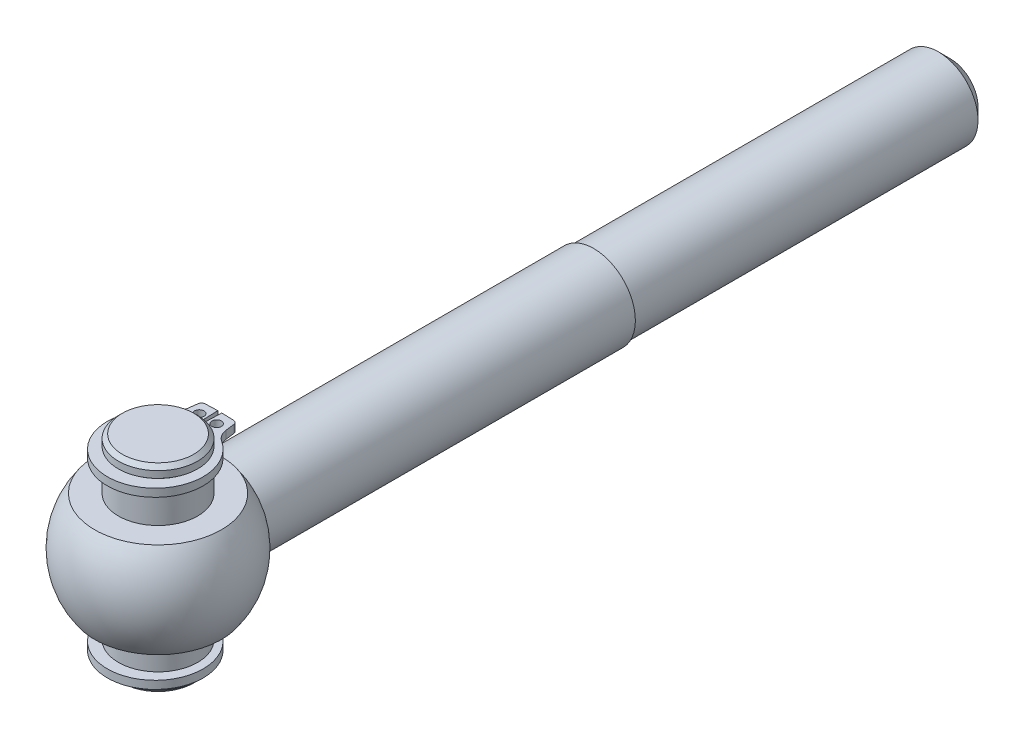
ISO-10303-21;
HEADER;
FILE_DESCRIPTION(('STEP AP214'),'2;1');
FILE_NAME('part.step','',(''),(''),'','','');
FILE_SCHEMA(('AUTOMOTIVE_DESIGN { 1 0 10303 214 1 1 1 1 }'));
ENDSEC;
DATA;
#1=APPLICATION_CONTEXT('core data for automotive mechanical design processes');
#2=APPLICATION_PROTOCOL_DEFINITION('international standard','automotive_design',2000,#1);
#3=PRODUCT_CONTEXT('',#1,'mechanical');
#4=PRODUCT('Part','Part','',(#3));
#5=PRODUCT_RELATED_PRODUCT_CATEGORY('part','',(#4));
#6=PRODUCT_DEFINITION_FORMATION('','',#4);
#7=PRODUCT_DEFINITION_CONTEXT('part definition',#1,'design');
#8=PRODUCT_DEFINITION('design','',#6,#7);
#9=PRODUCT_DEFINITION_SHAPE('','',#8);
#10=(LENGTH_UNIT() NAMED_UNIT(*) SI_UNIT(.MILLI.,.METRE.));
#11=(NAMED_UNIT(*) PLANE_ANGLE_UNIT() SI_UNIT($,.RADIAN.));
#12=(NAMED_UNIT(*) SI_UNIT($,.STERADIAN.) SOLID_ANGLE_UNIT());
#13=UNCERTAINTY_MEASURE_WITH_UNIT(LENGTH_MEASURE(1.E-05),#10,'distance_accuracy_value','');
#14=(GEOMETRIC_REPRESENTATION_CONTEXT(3) GLOBAL_UNCERTAINTY_ASSIGNED_CONTEXT((#13)) GLOBAL_UNIT_ASSIGNED_CONTEXT((#10,
#11,#12)) REPRESENTATION_CONTEXT('',''));
#15=CARTESIAN_POINT('',(0.,0.,0.));
#16=DIRECTION('',(0.,0.,1.));
#17=DIRECTION('',(1.,0.,0.));
#18=AXIS2_PLACEMENT_3D('',#15,#16,#17);
#19=CARTESIAN_POINT('',(0.,-11.0000000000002,100.));
#20=DIRECTION('',(0.,1.,0.));
#21=DIRECTION('',(-1.,0.,0.));
#22=AXIS2_PLACEMENT_3D('',#19,#20,#21);
#23=PLANE('',#22);
#24=CARTESIAN_POINT('',(1.09999999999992,-11.0000000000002,93.6952398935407));
#25=DIRECTION('',(0.,1.,0.));
#26=DIRECTION('',(-1.,0.,0.));
#27=AXIS2_PLACEMENT_3D('',#24,#25,#26);
#28=CIRCLE('',#27,0.6);
#29=CARTESIAN_POINT('',(0.499999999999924,-11.0000000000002,93.6952398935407));
#30=VERTEX_POINT('',#29);
#31=EDGE_CURVE('E953',#30,#30,#28,.T.);
#32=ORIENTED_EDGE('',*,*,#31,.T.);
#33=EDGE_LOOP('',(#32));
#34=FACE_BOUND('',#33,.T.);
#35=CARTESIAN_POINT('',(-1.10000000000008,-11.0000000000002,93.6952398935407));
#36=DIRECTION('',(0.,1.,0.));
#37=DIRECTION('',(-1.,0.,0.));
#38=AXIS2_PLACEMENT_3D('',#35,#36,#37);
#39=CIRCLE('',#38,0.6);
#40=CARTESIAN_POINT('',(-1.70000000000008,-11.0000000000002,93.6952398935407));
#41=VERTEX_POINT('',#40);
#42=EDGE_CURVE('E952',#41,#41,#39,.T.);
#43=ORIENTED_EDGE('',*,*,#42,.T.);
#44=EDGE_LOOP('',(#43));
#45=FACE_BOUND('',#44,.T.);
#46=CARTESIAN_POINT('',(0.,-11.0000000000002,100.));
#47=DIRECTION('',(0.,-1.,0.));
#48=DIRECTION('',(-1.,0.,0.));
#49=AXIS2_PLACEMENT_3D('',#46,#47,#48);
#50=CIRCLE('',#49,4.8);
#51=CARTESIAN_POINT('',(0.153846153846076,-11.0000000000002,95.2024661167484));
#52=VERTEX_POINT('',#51);
#53=CARTESIAN_POINT('',(-0.153846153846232,-11.0000000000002,95.2024661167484));
#54=VERTEX_POINT('',#53);
#55=EDGE_CURVE('E205',#52,#54,#50,.T.);
#56=ORIENTED_EDGE('',*,*,#55,.F.);
#57=DIRECTION('',(-0.0320512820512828,0.,0.999486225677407));
#58=VECTOR('',#57,1.);
#59=CARTESIAN_POINT('',(0.153846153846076,-11.0000000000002,95.2024661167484));
#60=LINE('',#59,#58);
#61=CARTESIAN_POINT('',(0.249999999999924,-11.0000000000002,92.2040074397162));
#62=VERTEX_POINT('',#61);
#63=EDGE_CURVE('E207',#62,#52,#60,.T.);
#64=ORIENTED_EDGE('',*,*,#63,.F.);
#65=DIRECTION('',(-0.999486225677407,0.,-0.0320512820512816));
#66=VECTOR('',#65,1.);
#67=CARTESIAN_POINT('',(0.249999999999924,-11.0000000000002,92.2040074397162));
#68=LINE('',#67,#66);
#69=CARTESIAN_POINT('',(1.77924534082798,-11.0000000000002,92.2530469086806));
#70=VERTEX_POINT('',#69);
#71=EDGE_CURVE('E218',#70,#62,#68,.T.);
#72=ORIENTED_EDGE('',*,*,#71,.F.);
#73=CARTESIAN_POINT('',(1.76321969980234,-11.0000000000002,92.7527900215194));
#74=DIRECTION('',(0.,1.,0.));
#75=DIRECTION('',(-1.,0.,0.));
#76=AXIS2_PLACEMENT_3D('',#73,#74,#75);
#77=CIRCLE('',#76,0.5);
#78=CARTESIAN_POINT('',(2.25894213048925,-11.0000000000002,92.6875269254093));
#79=VERTEX_POINT('',#78);
#80=EDGE_CURVE('E222',#79,#70,#77,.T.);
#81=ORIENTED_EDGE('',*,*,#80,.F.);
#82=DIRECTION('',(-0.130526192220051,0.,-0.99144486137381));
#83=VECTOR('',#82,1.);
#84=CARTESIAN_POINT('',(2.41181577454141,-11.0000000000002,93.8487175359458));
#85=LINE('',#84,#83);
#86=CARTESIAN_POINT('',(2.41181577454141,-11.0000000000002,93.8487175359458));
#87=VERTEX_POINT('',#86);
#88=EDGE_CURVE('E927',#87,#79,#85,.T.);
#89=ORIENTED_EDGE('',*,*,#88,.F.);
#90=CARTESIAN_POINT('',(4.43354857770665,-11.0000000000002,93.5825513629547));
#91=DIRECTION('',(0.,-1.,0.));
#92=DIRECTION('',(-1.,0.,0.));
#93=AXIS2_PLACEMENT_3D('',#90,#91,#92);
#94=CIRCLE('',#93,2.03917825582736);
#95=CARTESIAN_POINT('',(3.31600032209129,-11.0000000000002,95.2882283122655));
#96=VERTEX_POINT('',#95);
#97=EDGE_CURVE('E928',#96,#87,#94,.T.);
#98=ORIENTED_EDGE('',*,*,#97,.F.);
#99=CARTESIAN_POINT('',(0.,-11.0000000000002,100.349329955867));
#100=DIRECTION('',(0.,1.,0.));
#101=DIRECTION('',(-1.,0.,0.));
#102=AXIS2_PLACEMENT_3D('',#99,#100,#101);
#103=CIRCLE('',#102,6.05067004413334);
#104=CARTESIAN_POINT('',(-3.31600032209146,-11.0000000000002,95.2882283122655));
#105=VERTEX_POINT('',#104);
#106=EDGE_CURVE('E933',#105,#96,#103,.T.);
#107=ORIENTED_EDGE('',*,*,#106,.F.);
#108=CARTESIAN_POINT('',(-4.43354857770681,-11.0000000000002,93.5825513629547));
#109=DIRECTION('',(0.,-1.,0.));
#110=DIRECTION('',(-1.,0.,0.));
#111=AXIS2_PLACEMENT_3D('',#108,#109,#110);
#112=CIRCLE('',#111,2.03917825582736);
#113=CARTESIAN_POINT('',(-2.41181577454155,-11.0000000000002,93.8487175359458));
#114=VERTEX_POINT('',#113);
#115=EDGE_CURVE('E936',#114,#105,#112,.T.);
#116=ORIENTED_EDGE('',*,*,#115,.F.);
#117=DIRECTION('',(-0.130526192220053,0.,0.99144486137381));
#118=VECTOR('',#117,1.);
#119=CARTESIAN_POINT('',(-2.41181577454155,-11.0000000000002,93.8487175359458));
#120=LINE('',#119,#118);
#121=CARTESIAN_POINT('',(-2.2589421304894,-11.0000000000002,92.6875269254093));
#122=VERTEX_POINT('',#121);
#123=EDGE_CURVE('E939',#122,#114,#120,.T.);
#124=ORIENTED_EDGE('',*,*,#123,.F.);
#125=CARTESIAN_POINT('',(-1.76321969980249,-11.0000000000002,92.7527900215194));
#126=DIRECTION('',(0.,1.,0.));
#127=DIRECTION('',(1.,0.,0.));
#128=AXIS2_PLACEMENT_3D('',#125,#126,#127);
#129=CIRCLE('',#128,0.5);
#130=CARTESIAN_POINT('',(-1.77924534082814,-11.0000000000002,92.2530469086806));
#131=VERTEX_POINT('',#130);
#132=EDGE_CURVE('E942',#131,#122,#129,.T.);
#133=ORIENTED_EDGE('',*,*,#132,.F.);
#134=DIRECTION('',(-0.999486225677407,0.,0.0320512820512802));
#135=VECTOR('',#134,1.);
#136=CARTESIAN_POINT('',(-0.250000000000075,-11.0000000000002,92.2040074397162));
#137=LINE('',#136,#135);
#138=CARTESIAN_POINT('',(-0.250000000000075,-11.0000000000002,92.2040074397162));
#139=VERTEX_POINT('',#138);
#140=EDGE_CURVE('E945',#139,#131,#137,.T.);
#141=ORIENTED_EDGE('',*,*,#140,.F.);
#142=DIRECTION('',(-0.0320512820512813,0.,-0.999486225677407));
#143=VECTOR('',#142,1.);
#144=CARTESIAN_POINT('',(-0.153846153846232,-11.0000000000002,95.2024661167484));
#145=LINE('',#144,#143);
#146=EDGE_CURVE('E209',#54,#139,#145,.T.);
#147=ORIENTED_EDGE('',*,*,#146,.F.);
#148=EDGE_LOOP('',(#56,#64,#72,#81,#89,#98,#107,#116,#124,#133,#141,#147));
#149=FACE_BOUND('',#148,.T.);
#150=ADVANCED_FACE('F14',(#34,#45,#149),#23,.F.);
#151=CARTESIAN_POINT('',(-1.10000000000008,-11.0000000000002,93.6952398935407));
#152=DIRECTION('',(0.,1.,0.));
#153=DIRECTION('',(-1.,0.,0.));
#154=AXIS2_PLACEMENT_3D('',#151,#152,#153);
#155=CYLINDRICAL_SURFACE('',#154,0.6);
#156=ORIENTED_EDGE('',*,*,#42,.F.);
#157=EDGE_LOOP('',(#156));
#158=FACE_BOUND('',#157,.T.);
#159=CARTESIAN_POINT('',(-1.10000000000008,-10.0000000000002,93.6952398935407));
#160=DIRECTION('',(0.,1.,0.));
#161=DIRECTION('',(-1.,0.,0.));
#162=AXIS2_PLACEMENT_3D('',#159,#160,#161);
#163=CIRCLE('',#162,0.6);
#164=CARTESIAN_POINT('',(-1.70000000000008,-10.0000000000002,93.6952398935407));
#165=VERTEX_POINT('',#164);
#166=EDGE_CURVE('E949',#165,#165,#163,.T.);
#167=ORIENTED_EDGE('',*,*,#166,.T.);
#168=EDGE_LOOP('',(#167));
#169=FACE_BOUND('',#168,.T.);
#170=ADVANCED_FACE('F773',(#158,#169),#155,.F.);
#171=CARTESIAN_POINT('',(1.09999999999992,-11.0000000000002,93.6952398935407));
#172=DIRECTION('',(0.,1.,0.));
#173=DIRECTION('',(-1.,0.,0.));
#174=AXIS2_PLACEMENT_3D('',#171,#172,#173);
#175=CYLINDRICAL_SURFACE('',#174,0.6);
#176=ORIENTED_EDGE('',*,*,#31,.F.);
#177=EDGE_LOOP('',(#176));
#178=FACE_BOUND('',#177,.T.);
#179=CARTESIAN_POINT('',(1.09999999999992,-10.0000000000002,93.6952398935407));
#180=DIRECTION('',(0.,1.,0.));
#181=DIRECTION('',(-1.,0.,0.));
#182=AXIS2_PLACEMENT_3D('',#179,#180,#181);
#183=CIRCLE('',#182,0.6);
#184=CARTESIAN_POINT('',(0.499999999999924,-10.0000000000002,93.6952398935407));
#185=VERTEX_POINT('',#184);
#186=EDGE_CURVE('E385',#185,#185,#183,.T.);
#187=ORIENTED_EDGE('',*,*,#186,.T.);
#188=EDGE_LOOP('',(#187));
#189=FACE_BOUND('',#188,.T.);
#190=ADVANCED_FACE('F766',(#178,#189),#175,.F.);
#191=CARTESIAN_POINT('',(0.153846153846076,-11.0000000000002,95.2024661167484));
#192=DIRECTION('',(-0.999486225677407,0.,-0.0320512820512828));
#193=DIRECTION('',(-0.0320512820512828,0.,0.999486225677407));
#194=AXIS2_PLACEMENT_3D('',#191,#192,#193);
#195=PLANE('',#194);
#196=DIRECTION('',(-0.0320512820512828,0.,0.999486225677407));
#197=VECTOR('',#196,1.);
#198=CARTESIAN_POINT('',(0.153846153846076,-10.0000000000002,95.2024661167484));
#199=LINE('',#198,#197);
#200=CARTESIAN_POINT('',(0.249999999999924,-10.0000000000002,92.2040074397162));
#201=VERTEX_POINT('',#200);
#202=CARTESIAN_POINT('',(0.160256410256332,-10.0000000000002,95.002568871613));
#203=VERTEX_POINT('',#202);
#204=EDGE_CURVE('E210',#201,#203,#199,.T.);
#205=ORIENTED_EDGE('',*,*,#204,.F.);
#206=DIRECTION('',(0.,1.,0.));
#207=VECTOR('',#206,1.);
#208=CARTESIAN_POINT('',(0.249999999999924,-11.0000000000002,92.2040074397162));
#209=LINE('',#208,#207);
#210=EDGE_CURVE('E199',#62,#201,#209,.T.);
#211=ORIENTED_EDGE('',*,*,#210,.F.);
#212=ORIENTED_EDGE('',*,*,#63,.T.);
#213=DIRECTION('',(0.,1.,0.));
#214=VECTOR('',#213,1.);
#215=CARTESIAN_POINT('',(0.153846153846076,-11.0000000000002,95.2024661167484));
#216=LINE('',#215,#214);
#217=CARTESIAN_POINT('',(0.153846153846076,-10.0000000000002,95.2024661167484));
#218=VERTEX_POINT('',#217);
#219=EDGE_CURVE('E24',#52,#218,#216,.T.);
#220=ORIENTED_EDGE('',*,*,#219,.T.);
#221=EDGE_CURVE('E33',#203,#218,#199,.T.);
#222=ORIENTED_EDGE('',*,*,#221,.F.);
#223=EDGE_LOOP('',(#205,#211,#212,#220,#222));
#224=FACE_BOUND('',#223,.T.);
#225=ADVANCED_FACE('F217',(#224),#195,.T.);
#226=CARTESIAN_POINT('',(0.249999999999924,-11.0000000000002,92.2040074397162));
#227=DIRECTION('',(0.0320512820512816,0.,-0.999486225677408));
#228=DIRECTION('',(-0.999486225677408,0.,-0.0320512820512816));
#229=AXIS2_PLACEMENT_3D('',#226,#227,#228);
#230=PLANE('',#229);
#231=DIRECTION('',(-0.999486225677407,0.,-0.0320512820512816));
#232=VECTOR('',#231,1.);
#233=CARTESIAN_POINT('',(0.249999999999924,-10.0000000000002,92.2040074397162));
#234=LINE('',#233,#232);
#235=CARTESIAN_POINT('',(1.77924534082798,-10.0000000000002,92.2530469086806));
#236=VERTEX_POINT('',#235);
#237=EDGE_CURVE('E254',#236,#201,#234,.T.);
#238=ORIENTED_EDGE('',*,*,#237,.F.);
#239=DIRECTION('',(0.,1.,0.));
#240=VECTOR('',#239,1.);
#241=CARTESIAN_POINT('',(1.77924534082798,-11.0000000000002,92.2530469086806));
#242=LINE('',#241,#240);
#243=EDGE_CURVE('E260',#70,#236,#242,.T.);
#244=ORIENTED_EDGE('',*,*,#243,.F.);
#245=ORIENTED_EDGE('',*,*,#71,.T.);
#246=ORIENTED_EDGE('',*,*,#210,.T.);
#247=EDGE_LOOP('',(#238,#244,#245,#246));
#248=FACE_BOUND('',#247,.T.);
#249=ADVANCED_FACE('F751',(#248),#230,.T.);
#250=CARTESIAN_POINT('',(1.76321969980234,-11.0000000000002,92.7527900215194));
#251=DIRECTION('',(0.,1.,0.));
#252=DIRECTION('',(-1.,0.,0.));
#253=AXIS2_PLACEMENT_3D('',#250,#251,#252);
#254=CYLINDRICAL_SURFACE('',#253,0.5);
#255=CARTESIAN_POINT('',(1.76321969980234,-10.0000000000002,92.7527900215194));
#256=DIRECTION('',(0.,1.,0.));
#257=DIRECTION('',(-1.,0.,0.));
#258=AXIS2_PLACEMENT_3D('',#255,#256,#257);
#259=CIRCLE('',#258,0.5);
#260=CARTESIAN_POINT('',(2.25894213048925,-10.0000000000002,92.6875269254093));
#261=VERTEX_POINT('',#260);
#262=EDGE_CURVE('E251',#261,#236,#259,.T.);
#263=ORIENTED_EDGE('',*,*,#262,.F.);
#264=DIRECTION('',(0.,1.,0.));
#265=VECTOR('',#264,1.);
#266=CARTESIAN_POINT('',(2.25894213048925,-11.0000000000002,92.6875269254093));
#267=LINE('',#266,#265);
#268=EDGE_CURVE('E262',#79,#261,#267,.T.);
#269=ORIENTED_EDGE('',*,*,#268,.F.);
#270=ORIENTED_EDGE('',*,*,#80,.T.);
#271=ORIENTED_EDGE('',*,*,#243,.T.);
#272=EDGE_LOOP('',(#263,#269,#270,#271));
#273=FACE_BOUND('',#272,.T.);
#274=ADVANCED_FACE('F743',(#273),#254,.T.);
#275=CARTESIAN_POINT('',(2.41181577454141,-11.0000000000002,93.8487175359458));
#276=DIRECTION('',(0.99144486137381,0.,-0.130526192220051));
#277=DIRECTION('',(-0.130526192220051,0.,-0.99144486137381));
#278=AXIS2_PLACEMENT_3D('',#275,#276,#277);
#279=PLANE('',#278);
#280=DIRECTION('',(-0.130526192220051,0.,-0.99144486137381));
#281=VECTOR('',#280,1.);
#282=CARTESIAN_POINT('',(2.41181577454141,-10.0000000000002,93.8487175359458));
#283=LINE('',#282,#281);
#284=CARTESIAN_POINT('',(2.41181577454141,-10.0000000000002,93.8487175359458));
#285=VERTEX_POINT('',#284);
#286=EDGE_CURVE('E248',#285,#261,#283,.T.);
#287=ORIENTED_EDGE('',*,*,#286,.F.);
#288=DIRECTION('',(0.,1.,0.));
#289=VECTOR('',#288,1.);
#290=CARTESIAN_POINT('',(2.41181577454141,-11.0000000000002,93.8487175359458));
#291=LINE('',#290,#289);
#292=EDGE_CURVE('E264',#87,#285,#291,.T.);
#293=ORIENTED_EDGE('',*,*,#292,.F.);
#294=ORIENTED_EDGE('',*,*,#88,.T.);
#295=ORIENTED_EDGE('',*,*,#268,.T.);
#296=EDGE_LOOP('',(#287,#293,#294,#295));
#297=FACE_BOUND('',#296,.T.);
#298=ADVANCED_FACE('F735',(#297),#279,.T.);
#299=CARTESIAN_POINT('',(4.43354857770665,-11.0000000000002,93.5825513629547));
#300=DIRECTION('',(0.,1.,0.));
#301=DIRECTION('',(-1.,0.,0.));
#302=AXIS2_PLACEMENT_3D('',#299,#300,#301);
#303=CYLINDRICAL_SURFACE('',#302,2.03917825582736);
#304=CARTESIAN_POINT('',(4.43354857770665,-10.0000000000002,93.5825513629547));
#305=DIRECTION('',(0.,-1.,0.));
#306=DIRECTION('',(-1.,0.,0.));
#307=AXIS2_PLACEMENT_3D('',#304,#305,#306);
#308=CIRCLE('',#307,2.03917825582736);
#309=CARTESIAN_POINT('',(3.31600032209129,-10.0000000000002,95.2882283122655));
#310=VERTEX_POINT('',#309);
#311=EDGE_CURVE('E245',#310,#285,#308,.T.);
#312=ORIENTED_EDGE('',*,*,#311,.F.);
#313=DIRECTION('',(0.,1.,0.));
#314=VECTOR('',#313,1.);
#315=CARTESIAN_POINT('',(3.31600032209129,-11.0000000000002,95.2882283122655));
#316=LINE('',#315,#314);
#317=EDGE_CURVE('E266',#96,#310,#316,.T.);
#318=ORIENTED_EDGE('',*,*,#317,.F.);
#319=ORIENTED_EDGE('',*,*,#97,.T.);
#320=ORIENTED_EDGE('',*,*,#292,.T.);
#321=EDGE_LOOP('',(#312,#318,#319,#320));
#322=FACE_BOUND('',#321,.T.);
#323=ADVANCED_FACE('F727',(#322),#303,.F.);
#324=CARTESIAN_POINT('',(0.,-11.0000000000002,100.349329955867));
#325=DIRECTION('',(0.,1.,0.));
#326=DIRECTION('',(-1.,0.,0.));
#327=AXIS2_PLACEMENT_3D('',#324,#325,#326);
#328=CYLINDRICAL_SURFACE('',#327,6.05067004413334);
#329=CARTESIAN_POINT('',(0.,-10.0000000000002,100.349329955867));
#330=DIRECTION('',(0.,1.,0.));
#331=DIRECTION('',(-1.,0.,0.));
#332=AXIS2_PLACEMENT_3D('',#329,#330,#331);
#333=CIRCLE('',#332,6.05067004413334);
#334=CARTESIAN_POINT('',(-3.31600032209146,-10.0000000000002,95.2882283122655));
#335=VERTEX_POINT('',#334);
#336=EDGE_CURVE('E242',#335,#310,#333,.T.);
#337=ORIENTED_EDGE('',*,*,#336,.F.);
#338=DIRECTION('',(0.,1.,0.));
#339=VECTOR('',#338,1.);
#340=CARTESIAN_POINT('',(-3.31600032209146,-11.0000000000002,95.2882283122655));
#341=LINE('',#340,#339);
#342=EDGE_CURVE('E268',#105,#335,#341,.T.);
#343=ORIENTED_EDGE('',*,*,#342,.F.);
#344=ORIENTED_EDGE('',*,*,#106,.T.);
#345=ORIENTED_EDGE('',*,*,#317,.T.);
#346=EDGE_LOOP('',(#337,#343,#344,#345));
#347=FACE_BOUND('',#346,.T.);
#348=ADVANCED_FACE('F719',(#347),#328,.T.);
#349=CARTESIAN_POINT('',(-4.43354857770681,-11.0000000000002,93.5825513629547));
#350=DIRECTION('',(0.,1.,0.));
#351=DIRECTION('',(-1.,0.,0.));
#352=AXIS2_PLACEMENT_3D('',#349,#350,#351);
#353=CYLINDRICAL_SURFACE('',#352,2.03917825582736);
#354=CARTESIAN_POINT('',(-4.43354857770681,-10.0000000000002,93.5825513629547));
#355=DIRECTION('',(0.,-1.,0.));
#356=DIRECTION('',(-1.,0.,0.));
#357=AXIS2_PLACEMENT_3D('',#354,#355,#356);
#358=CIRCLE('',#357,2.03917825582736);
#359=CARTESIAN_POINT('',(-2.41181577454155,-10.0000000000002,93.8487175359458));
#360=VERTEX_POINT('',#359);
#361=EDGE_CURVE('E239',#360,#335,#358,.T.);
#362=ORIENTED_EDGE('',*,*,#361,.F.);
#363=DIRECTION('',(0.,1.,0.));
#364=VECTOR('',#363,1.);
#365=CARTESIAN_POINT('',(-2.41181577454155,-11.0000000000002,93.8487175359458));
#366=LINE('',#365,#364);
#367=EDGE_CURVE('E270',#114,#360,#366,.T.);
#368=ORIENTED_EDGE('',*,*,#367,.F.);
#369=ORIENTED_EDGE('',*,*,#115,.T.);
#370=ORIENTED_EDGE('',*,*,#342,.T.);
#371=EDGE_LOOP('',(#362,#368,#369,#370));
#372=FACE_BOUND('',#371,.T.);
#373=ADVANCED_FACE('F711',(#372),#353,.F.);
#374=CARTESIAN_POINT('',(-2.41181577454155,-11.0000000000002,93.8487175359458));
#375=DIRECTION('',(-0.99144486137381,0.,-0.130526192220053));
#376=DIRECTION('',(-0.130526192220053,0.,0.99144486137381));
#377=AXIS2_PLACEMENT_3D('',#374,#375,#376);
#378=PLANE('',#377);
#379=DIRECTION('',(-0.130526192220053,0.,0.99144486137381));
#380=VECTOR('',#379,1.);
#381=CARTESIAN_POINT('',(-2.41181577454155,-10.0000000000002,93.8487175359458));
#382=LINE('',#381,#380);
#383=CARTESIAN_POINT('',(-2.2589421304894,-10.0000000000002,92.6875269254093));
#384=VERTEX_POINT('',#383);
#385=EDGE_CURVE('E236',#384,#360,#382,.T.);
#386=ORIENTED_EDGE('',*,*,#385,.F.);
#387=DIRECTION('',(0.,1.,0.));
#388=VECTOR('',#387,1.);
#389=CARTESIAN_POINT('',(-2.2589421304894,-11.0000000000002,92.6875269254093));
#390=LINE('',#389,#388);
#391=EDGE_CURVE('E272',#122,#384,#390,.T.);
#392=ORIENTED_EDGE('',*,*,#391,.F.);
#393=ORIENTED_EDGE('',*,*,#123,.T.);
#394=ORIENTED_EDGE('',*,*,#367,.T.);
#395=EDGE_LOOP('',(#386,#392,#393,#394));
#396=FACE_BOUND('',#395,.T.);
#397=ADVANCED_FACE('F703',(#396),#378,.T.);
#398=CARTESIAN_POINT('',(-1.76321969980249,-11.0000000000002,92.7527900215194));
#399=DIRECTION('',(0.,1.,0.));
#400=DIRECTION('',(-1.,0.,0.));
#401=AXIS2_PLACEMENT_3D('',#398,#399,#400);
#402=CYLINDRICAL_SURFACE('',#401,0.5);
#403=CARTESIAN_POINT('',(-1.76321969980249,-10.0000000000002,92.7527900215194));
#404=DIRECTION('',(0.,1.,0.));
#405=DIRECTION('',(1.,0.,0.));
#406=AXIS2_PLACEMENT_3D('',#403,#404,#405);
#407=CIRCLE('',#406,0.5);
#408=CARTESIAN_POINT('',(-1.77924534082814,-10.0000000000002,92.2530469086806));
#409=VERTEX_POINT('',#408);
#410=EDGE_CURVE('E233',#409,#384,#407,.T.);
#411=ORIENTED_EDGE('',*,*,#410,.F.);
#412=DIRECTION('',(0.,1.,0.));
#413=VECTOR('',#412,1.);
#414=CARTESIAN_POINT('',(-1.77924534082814,-11.0000000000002,92.2530469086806));
#415=LINE('',#414,#413);
#416=EDGE_CURVE('E274',#131,#409,#415,.T.);
#417=ORIENTED_EDGE('',*,*,#416,.F.);
#418=ORIENTED_EDGE('',*,*,#132,.T.);
#419=ORIENTED_EDGE('',*,*,#391,.T.);
#420=EDGE_LOOP('',(#411,#417,#418,#419));
#421=FACE_BOUND('',#420,.T.);
#422=ADVANCED_FACE('F695',(#421),#402,.T.);
#423=CARTESIAN_POINT('',(-0.250000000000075,-11.0000000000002,92.2040074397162));
#424=DIRECTION('',(-0.0320512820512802,0.,-0.999486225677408));
#425=DIRECTION('',(-0.999486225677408,0.,0.0320512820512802));
#426=AXIS2_PLACEMENT_3D('',#423,#424,#425);
#427=PLANE('',#426);
#428=DIRECTION('',(-0.999486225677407,0.,0.0320512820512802));
#429=VECTOR('',#428,1.);
#430=CARTESIAN_POINT('',(-0.250000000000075,-10.0000000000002,92.2040074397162));
#431=LINE('',#430,#429);
#432=CARTESIAN_POINT('',(-0.250000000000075,-10.0000000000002,92.2040074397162));
#433=VERTEX_POINT('',#432);
#434=EDGE_CURVE('E229',#433,#409,#431,.T.);
#435=ORIENTED_EDGE('',*,*,#434,.F.);
#436=DIRECTION('',(0.,1.,0.));
#437=VECTOR('',#436,1.);
#438=CARTESIAN_POINT('',(-0.250000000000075,-11.0000000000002,92.2040074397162));
#439=LINE('',#438,#437);
#440=EDGE_CURVE('E220',#139,#433,#439,.T.);
#441=ORIENTED_EDGE('',*,*,#440,.F.);
#442=ORIENTED_EDGE('',*,*,#140,.T.);
#443=ORIENTED_EDGE('',*,*,#416,.T.);
#444=EDGE_LOOP('',(#435,#441,#442,#443));
#445=FACE_BOUND('',#444,.T.);
#446=ADVANCED_FACE('F688',(#445),#427,.T.);
#447=CARTESIAN_POINT('',(-0.153846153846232,-11.0000000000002,95.2024661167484));
#448=DIRECTION('',(0.999486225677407,0.,-0.0320512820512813));
#449=DIRECTION('',(-0.0320512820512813,0.,-0.999486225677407));
#450=AXIS2_PLACEMENT_3D('',#447,#448,#449);
#451=PLANE('',#450);
#452=DIRECTION('',(-0.0320512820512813,0.,-0.999486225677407));
#453=VECTOR('',#452,1.);
#454=CARTESIAN_POINT('',(-0.153846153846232,-10.0000000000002,95.2024661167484));
#455=LINE('',#454,#453);
#456=CARTESIAN_POINT('',(-0.153846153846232,-10.0000000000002,95.2024661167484));
#457=VERTEX_POINT('',#456);
#458=CARTESIAN_POINT('',(-0.160256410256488,-10.0000000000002,95.002568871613));
#459=VERTEX_POINT('',#458);
#460=EDGE_CURVE('E226',#457,#459,#455,.T.);
#461=ORIENTED_EDGE('',*,*,#460,.F.);
#462=DIRECTION('',(0.,1.,0.));
#463=VECTOR('',#462,1.);
#464=CARTESIAN_POINT('',(-0.153846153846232,-11.0000000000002,95.2024661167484));
#465=LINE('',#464,#463);
#466=EDGE_CURVE('E130',#54,#457,#465,.T.);
#467=ORIENTED_EDGE('',*,*,#466,.F.);
#468=ORIENTED_EDGE('',*,*,#146,.T.);
#469=ORIENTED_EDGE('',*,*,#440,.T.);
#470=EDGE_CURVE('E230',#459,#433,#455,.T.);
#471=ORIENTED_EDGE('',*,*,#470,.F.);
#472=EDGE_LOOP('',(#461,#467,#468,#469,#471));
#473=FACE_BOUND('',#472,.T.);
#474=ADVANCED_FACE('F680',(#473),#451,.T.);
#475=CARTESIAN_POINT('',(0.,-10.0000000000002,100.));
#476=DIRECTION('',(0.,1.,0.));
#477=DIRECTION('',(-1.,0.,0.));
#478=AXIS2_PLACEMENT_3D('',#475,#476,#477);
#479=PLANE('',#478);
#480=CARTESIAN_POINT('',(0.,-10.0000000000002,100.));
#481=DIRECTION('',(0.,1.,0.));
#482=DIRECTION('',(1.,0.,0.));
#483=AXIS2_PLACEMENT_3D('',#480,#481,#482);
#484=CIRCLE('',#483,5.);
#485=EDGE_CURVE('E9',#459,#203,#484,.T.);
#486=ORIENTED_EDGE('',*,*,#485,.F.);
#487=ORIENTED_EDGE('',*,*,#470,.T.);
#488=ORIENTED_EDGE('',*,*,#434,.T.);
#489=ORIENTED_EDGE('',*,*,#410,.T.);
#490=ORIENTED_EDGE('',*,*,#385,.T.);
#491=ORIENTED_EDGE('',*,*,#361,.T.);
#492=ORIENTED_EDGE('',*,*,#336,.T.);
#493=ORIENTED_EDGE('',*,*,#311,.T.);
#494=ORIENTED_EDGE('',*,*,#286,.T.);
#495=ORIENTED_EDGE('',*,*,#262,.T.);
#496=ORIENTED_EDGE('',*,*,#237,.T.);
#497=ORIENTED_EDGE('',*,*,#204,.T.);
#498=EDGE_LOOP('',(#486,#487,#488,#489,#490,#491,#492,#493,#494,#495,#496,#497));
#499=FACE_BOUND('',#498,.T.);
#500=ORIENTED_EDGE('',*,*,#186,.F.);
#501=EDGE_LOOP('',(#500));
#502=FACE_BOUND('',#501,.T.);
#503=ORIENTED_EDGE('',*,*,#166,.F.);
#504=EDGE_LOOP('',(#503));
#505=FACE_BOUND('',#504,.T.);
#506=ADVANCED_FACE('F562',(#499,#502,#505),#479,.T.);
#507=CARTESIAN_POINT('',(0.,12.4999999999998,100.));
#508=DIRECTION('',(0.,-1.,0.));
#509=DIRECTION('',(0.,0.,-1.));
#510=AXIS2_PLACEMENT_3D('',#507,#508,#509);
#511=PLANE('',#510);
#512=CARTESIAN_POINT('',(0.,12.4999999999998,100.));
#513=DIRECTION('',(0.,-1.,0.));
#514=DIRECTION('',(0.,0.,-1.));
#515=AXIS2_PLACEMENT_3D('',#512,#513,#514);
#516=CIRCLE('',#515,4.5);
#517=CARTESIAN_POINT('',(0.,12.4999999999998,95.5));
#518=VERTEX_POINT('',#517);
#519=EDGE_CURVE('E437',#518,#518,#516,.F.);
#520=ORIENTED_EDGE('',*,*,#519,.T.);
#521=EDGE_LOOP('',(#520));
#522=FACE_BOUND('',#521,.T.);
#523=ADVANCED_FACE('F493',(#522),#511,.F.);
#524=CARTESIAN_POINT('',(0.,11.9999999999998,100.));
#525=DIRECTION('',(0.,-1.,0.));
#526=DIRECTION('',(0.,0.,-1.));
#527=AXIS2_PLACEMENT_3D('',#524,#525,#526);
#528=CONICAL_SURFACE('',#527,5.,0.78539816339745);
#529=ORIENTED_EDGE('',*,*,#519,.F.);
#530=EDGE_LOOP('',(#529));
#531=FACE_BOUND('',#530,.T.);
#532=CARTESIAN_POINT('',(0.,11.9999999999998,100.));
#533=DIRECTION('',(0.,-1.,0.));
#534=DIRECTION('',(0.,0.,-1.));
#535=AXIS2_PLACEMENT_3D('',#532,#533,#534);
#536=CIRCLE('',#535,5.);
#537=CARTESIAN_POINT('',(0.,11.9999999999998,95.));
#538=VERTEX_POINT('',#537);
#539=EDGE_CURVE('E432',#538,#538,#536,.T.);
#540=ORIENTED_EDGE('',*,*,#539,.F.);
#541=EDGE_LOOP('',(#540));
#542=FACE_BOUND('',#541,.T.);
#543=ADVANCED_FACE('F491',(#531,#542),#528,.T.);
#544=CARTESIAN_POINT('',(0.,12.4999999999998,100.));
#545=DIRECTION('',(0.,-1.,0.));
#546=DIRECTION('',(0.,0.,-1.));
#547=AXIS2_PLACEMENT_3D('',#544,#545,#546);
#548=CYLINDRICAL_SURFACE('',#547,5.);
#549=ORIENTED_EDGE('',*,*,#539,.T.);
#550=EDGE_LOOP('',(#549));
#551=FACE_BOUND('',#550,.T.);
#552=CARTESIAN_POINT('',(0.,11.1499999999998,100.));
#553=DIRECTION('',(0.,-1.,0.));
#554=DIRECTION('',(0.,0.,-1.));
#555=AXIS2_PLACEMENT_3D('',#552,#553,#554);
#556=CIRCLE('',#555,5.);
#557=CARTESIAN_POINT('',(0.,11.1499999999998,95.));
#558=VERTEX_POINT('',#557);
#559=EDGE_CURVE('E419',#558,#558,#556,.T.);
#560=ORIENTED_EDGE('',*,*,#559,.F.);
#561=EDGE_LOOP('',(#560));
#562=FACE_BOUND('',#561,.T.);
#563=ADVANCED_FACE('F466',(#551,#562),#548,.T.);
#564=CARTESIAN_POINT('',(-3.5,0.,0.));
#565=DIRECTION('',(0.,0.,-1.));
#566=DIRECTION('',(0.,-1.,0.));
#567=AXIS2_PLACEMENT_3D('',#564,#565,#566);
#568=PLANE('',#567);
#569=CARTESIAN_POINT('',(0.,0.,0.));
#570=DIRECTION('',(0.,0.,1.));
#571=DIRECTION('',(0.,1.,0.));
#572=AXIS2_PLACEMENT_3D('',#569,#570,#571);
#573=CIRCLE('',#572,3.5);
#574=CARTESIAN_POINT('',(0.,3.5,0.));
#575=VERTEX_POINT('',#574);
#576=EDGE_CURVE('E400',#575,#575,#573,.T.);
#577=ORIENTED_EDGE('',*,*,#576,.F.);
#578=EDGE_LOOP('',(#577));
#579=FACE_BOUND('',#578,.T.);
#580=ADVANCED_FACE('F477',(#579),#568,.T.);
#581=CARTESIAN_POINT('',(0.,11.1499999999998,100.));
#582=DIRECTION('',(0.,1.,0.));
#583=DIRECTION('',(0.,0.,-1.));
#584=AXIS2_PLACEMENT_3D('',#581,#582,#583);
#585=PLANE('',#584);
#586=CARTESIAN_POINT('',(0.,11.1499999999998,100.));
#587=DIRECTION('',(0.,-1.,0.));
#588=DIRECTION('',(0.,0.,-1.));
#589=AXIS2_PLACEMENT_3D('',#586,#587,#588);
#590=CIRCLE('',#589,4.8);
#591=CARTESIAN_POINT('',(0.,11.1499999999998,95.2));
#592=VERTEX_POINT('',#591);
#593=EDGE_CURVE('E412',#592,#592,#590,.T.);
#594=ORIENTED_EDGE('',*,*,#593,.F.);
#595=EDGE_LOOP('',(#594));
#596=FACE_BOUND('',#595,.T.);
#597=ORIENTED_EDGE('',*,*,#559,.T.);
#598=EDGE_LOOP('',(#597));
#599=FACE_BOUND('',#598,.T.);
#600=ADVANCED_FACE('F468',(#596,#599),#585,.F.);
#601=CARTESIAN_POINT('',(-4.91045706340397E-13,10.9999999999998,100.));
#602=DIRECTION('',(0.,-1.,0.));
#603=DIRECTION('',(1.,0.,0.));
#604=AXIS2_PLACEMENT_3D('',#601,#602,#603);
#605=PLANE('',#604);
#606=CARTESIAN_POINT('',(-1.10000000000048,10.9999999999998,93.6952398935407));
#607=DIRECTION('',(0.,-1.,0.));
#608=DIRECTION('',(1.,0.,0.));
#609=AXIS2_PLACEMENT_3D('',#606,#607,#608);
#610=CIRCLE('',#609,0.6);
#611=CARTESIAN_POINT('',(-0.500000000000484,10.9999999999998,93.6952398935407));
#612=VERTEX_POINT('',#611);
#613=EDGE_CURVE('E278',#612,#612,#610,.T.);
#614=ORIENTED_EDGE('',*,*,#613,.T.);
#615=EDGE_LOOP('',(#614));
#616=FACE_BOUND('',#615,.T.);
#617=CARTESIAN_POINT('',(1.09999999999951,10.9999999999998,93.6952398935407));
#618=DIRECTION('',(0.,-1.,0.));
#619=DIRECTION('',(1.,0.,0.));
#620=AXIS2_PLACEMENT_3D('',#617,#618,#619);
#621=CIRCLE('',#620,0.6);
#622=CARTESIAN_POINT('',(1.69999999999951,10.9999999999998,93.6952398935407));
#623=VERTEX_POINT('',#622);
#624=EDGE_CURVE('E286',#623,#623,#621,.T.);
#625=ORIENTED_EDGE('',*,*,#624,.T.);
#626=EDGE_LOOP('',(#625));
#627=FACE_BOUND('',#626,.T.);
#628=CARTESIAN_POINT('',(-4.91045706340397E-13,10.9999999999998,100.));
#629=DIRECTION('',(0.,1.,0.));
#630=DIRECTION('',(1.,0.,0.));
#631=AXIS2_PLACEMENT_3D('',#628,#629,#630);
#632=CIRCLE('',#631,4.8);
#633=CARTESIAN_POINT('',(-0.15384615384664,10.9999999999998,95.2024661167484));
#634=VERTEX_POINT('',#633);
#635=CARTESIAN_POINT('',(0.153846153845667,10.9999999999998,95.2024661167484));
#636=VERTEX_POINT('',#635);
#637=EDGE_CURVE('E292',#634,#636,#632,.T.);
#638=ORIENTED_EDGE('',*,*,#637,.F.);
#639=DIRECTION('',(0.0320512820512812,0.,0.999486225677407));
#640=VECTOR('',#639,1.);
#641=CARTESIAN_POINT('',(-0.15384615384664,10.9999999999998,95.2024661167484));
#642=LINE('',#641,#640);
#643=CARTESIAN_POINT('',(-0.250000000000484,10.9999999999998,92.2040074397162));
#644=VERTEX_POINT('',#643);
#645=EDGE_CURVE('E326',#644,#634,#642,.T.);
#646=ORIENTED_EDGE('',*,*,#645,.F.);
#647=DIRECTION('',(0.999486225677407,0.,-0.03205128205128));
#648=VECTOR('',#647,1.);
#649=CARTESIAN_POINT('',(-0.250000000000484,10.9999999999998,92.2040074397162));
#650=LINE('',#649,#648);
#651=CARTESIAN_POINT('',(-1.77924534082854,10.9999999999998,92.2530469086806));
#652=VERTEX_POINT('',#651);
#653=EDGE_CURVE('E323',#652,#644,#650,.T.);
#654=ORIENTED_EDGE('',*,*,#653,.F.);
#655=CARTESIAN_POINT('',(-1.76321969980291,10.9999999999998,92.7527900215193));
#656=DIRECTION('',(0.,-1.,0.));
#657=DIRECTION('',(1.,0.,0.));
#658=AXIS2_PLACEMENT_3D('',#655,#656,#657);
#659=CIRCLE('',#658,0.5);
#660=CARTESIAN_POINT('',(-2.25894213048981,10.9999999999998,92.6875269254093));
#661=VERTEX_POINT('',#660);
#662=EDGE_CURVE('E320',#661,#652,#659,.T.);
#663=ORIENTED_EDGE('',*,*,#662,.F.);
#664=DIRECTION('',(0.130526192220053,0.,-0.99144486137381));
#665=VECTOR('',#664,1.);
#666=CARTESIAN_POINT('',(-2.41181577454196,10.9999999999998,93.8487175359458));
#667=LINE('',#666,#665);
#668=CARTESIAN_POINT('',(-2.41181577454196,10.9999999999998,93.8487175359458));
#669=VERTEX_POINT('',#668);
#670=EDGE_CURVE('E317',#669,#661,#667,.T.);
#671=ORIENTED_EDGE('',*,*,#670,.F.);
#672=CARTESIAN_POINT('',(-4.43354857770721,10.9999999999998,93.5825513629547));
#673=DIRECTION('',(0.,1.,0.));
#674=DIRECTION('',(1.,0.,0.));
#675=AXIS2_PLACEMENT_3D('',#672,#673,#674);
#676=CIRCLE('',#675,2.03917825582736);
#677=CARTESIAN_POINT('',(-3.31600032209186,10.9999999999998,95.2882283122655));
#678=VERTEX_POINT('',#677);
#679=EDGE_CURVE('E314',#678,#669,#676,.T.);
#680=ORIENTED_EDGE('',*,*,#679,.F.);
#681=CARTESIAN_POINT('',(-4.91379362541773E-13,10.9999999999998,100.349329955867));
#682=DIRECTION('',(0.,-1.,0.));
#683=DIRECTION('',(1.,0.,0.));
#684=AXIS2_PLACEMENT_3D('',#681,#682,#683);
#685=CIRCLE('',#684,6.05067004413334);
#686=CARTESIAN_POINT('',(3.31600032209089,10.9999999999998,95.2882283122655));
#687=VERTEX_POINT('',#686);
#688=EDGE_CURVE('E311',#687,#678,#685,.T.);
#689=ORIENTED_EDGE('',*,*,#688,.F.);
#690=CARTESIAN_POINT('',(4.43354857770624,10.9999999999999,93.5825513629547));
#691=DIRECTION('',(0.,1.,0.));
#692=DIRECTION('',(1.,0.,0.));
#693=AXIS2_PLACEMENT_3D('',#690,#691,#692);
#694=CIRCLE('',#693,2.03917825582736);
#695=CARTESIAN_POINT('',(2.411815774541,10.9999999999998,93.8487175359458));
#696=VERTEX_POINT('',#695);
#697=EDGE_CURVE('E308',#696,#687,#694,.T.);
#698=ORIENTED_EDGE('',*,*,#697,.F.);
#699=DIRECTION('',(0.130526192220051,0.,0.99144486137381));
#700=VECTOR('',#699,1.);
#701=CARTESIAN_POINT('',(2.411815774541,10.9999999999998,93.8487175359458));
#702=LINE('',#701,#700);
#703=CARTESIAN_POINT('',(2.25894213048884,10.9999999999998,92.6875269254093));
#704=VERTEX_POINT('',#703);
#705=EDGE_CURVE('E305',#704,#696,#702,.T.);
#706=ORIENTED_EDGE('',*,*,#705,.F.);
#707=CARTESIAN_POINT('',(1.76321969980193,10.9999999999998,92.7527900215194));
#708=DIRECTION('',(0.,-1.,0.));
#709=DIRECTION('',(-1.,0.,0.));
#710=AXIS2_PLACEMENT_3D('',#707,#708,#709);
#711=CIRCLE('',#710,0.5);
#712=CARTESIAN_POINT('',(1.77924534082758,10.9999999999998,92.2530469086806));
#713=VERTEX_POINT('',#712);
#714=EDGE_CURVE('E302',#713,#704,#711,.T.);
#715=ORIENTED_EDGE('',*,*,#714,.F.);
#716=DIRECTION('',(0.999486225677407,0.,0.0320512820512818));
#717=VECTOR('',#716,1.);
#718=CARTESIAN_POINT('',(0.249999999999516,10.9999999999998,92.2040074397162));
#719=LINE('',#718,#717);
#720=CARTESIAN_POINT('',(0.249999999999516,10.9999999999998,92.2040074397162));
#721=VERTEX_POINT('',#720);
#722=EDGE_CURVE('E299',#721,#713,#719,.T.);
#723=ORIENTED_EDGE('',*,*,#722,.F.);
#724=DIRECTION('',(0.032051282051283,0.,-0.999486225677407));
#725=VECTOR('',#724,1.);
#726=CARTESIAN_POINT('',(0.153846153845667,10.9999999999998,95.2024661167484));
#727=LINE('',#726,#725);
#728=EDGE_CURVE('E295',#636,#721,#727,.T.);
#729=ORIENTED_EDGE('',*,*,#728,.F.);
#730=EDGE_LOOP('',(#638,#646,#654,#663,#671,#680,#689,#698,#706,#715,#723,#729));
#731=FACE_BOUND('',#730,.T.);
#732=ADVANCED_FACE('F487',(#616,#627,#731),#605,.F.);
#733=CARTESIAN_POINT('',(0.,0.,0.));
#734=DIRECTION('',(0.,0.,1.));
#735=DIRECTION('',(0.,1.,0.));
#736=AXIS2_PLACEMENT_3D('',#733,#734,#735);
#737=CONICAL_SURFACE('',#736,3.5,0.785398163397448);
#738=CARTESIAN_POINT('',(0.,0.,1.5));
#739=DIRECTION('',(0.,0.,1.));
#740=DIRECTION('',(0.,1.,0.));
#741=AXIS2_PLACEMENT_3D('',#738,#739,#740);
#742=CIRCLE('',#741,5.);
#743=CARTESIAN_POINT('',(0.,5.,1.5));
#744=VERTEX_POINT('',#743);
#745=EDGE_CURVE('E285',#744,#744,#742,.T.);
#746=ORIENTED_EDGE('',*,*,#745,.F.);
#747=EDGE_LOOP('',(#746));
#748=FACE_BOUND('',#747,.T.);
#749=ORIENTED_EDGE('',*,*,#576,.T.);
#750=EDGE_LOOP('',(#749));
#751=FACE_BOUND('',#750,.T.);
#752=ADVANCED_FACE('F481',(#748,#751),#737,.T.);
#753=CARTESIAN_POINT('',(0.,11.1499999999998,100.));
#754=DIRECTION('',(0.,-1.,0.));
#755=DIRECTION('',(0.,0.,-1.));
#756=AXIS2_PLACEMENT_3D('',#753,#754,#755);
#757=CYLINDRICAL_SURFACE('',#756,4.8);
#758=CARTESIAN_POINT('',(0.,9.99999999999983,100.));
#759=DIRECTION('',(0.,-1.,0.));
#760=DIRECTION('',(0.,0.,-1.));
#761=AXIS2_PLACEMENT_3D('',#758,#759,#760);
#762=CIRCLE('',#761,4.8);
#763=CARTESIAN_POINT('',(-0.153846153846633,9.99999999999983,95.2024661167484));
#764=VERTEX_POINT('',#763);
#765=CARTESIAN_POINT('',(0.153846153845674,9.99999999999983,95.2024661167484));
#766=VERTEX_POINT('',#765);
#767=EDGE_CURVE('E416',#764,#766,#762,.T.);
#768=ORIENTED_EDGE('',*,*,#767,.F.);
#769=DIRECTION('',(0.,-1.,0.));
#770=VECTOR('',#769,1.);
#771=CARTESIAN_POINT('',(-0.15384615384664,10.9999999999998,95.2024661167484));
#772=LINE('',#771,#770);
#773=EDGE_CURVE('E360',#634,#764,#772,.T.);
#774=ORIENTED_EDGE('',*,*,#773,.F.);
#775=ORIENTED_EDGE('',*,*,#637,.T.);
#776=DIRECTION('',(0.,-1.,0.));
#777=VECTOR('',#776,1.);
#778=CARTESIAN_POINT('',(0.153846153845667,10.9999999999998,95.2024661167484));
#779=LINE('',#778,#777);
#780=EDGE_CURVE('E329',#636,#766,#779,.T.);
#781=ORIENTED_EDGE('',*,*,#780,.T.);
#782=EDGE_LOOP('',(#768,#774,#775,#781));
#783=FACE_BOUND('',#782,.T.);
#784=ORIENTED_EDGE('',*,*,#593,.T.);
#785=EDGE_LOOP('',(#784));
#786=FACE_BOUND('',#785,.T.);
#787=ADVANCED_FACE('F498',(#783,#786),#757,.T.);
#788=CARTESIAN_POINT('',(1.09999999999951,10.9999999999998,93.6952398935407));
#789=DIRECTION('',(0.,-1.,0.));
#790=DIRECTION('',(1.,0.,0.));
#791=AXIS2_PLACEMENT_3D('',#788,#789,#790);
#792=CYLINDRICAL_SURFACE('',#791,0.6);
#793=ORIENTED_EDGE('',*,*,#624,.F.);
#794=EDGE_LOOP('',(#793));
#795=FACE_BOUND('',#794,.T.);
#796=CARTESIAN_POINT('',(1.09999999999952,9.99999999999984,93.6952398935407));
#797=DIRECTION('',(0.,-1.,0.));
#798=DIRECTION('',(1.,0.,0.));
#799=AXIS2_PLACEMENT_3D('',#796,#797,#798);
#800=CIRCLE('',#799,0.6);
#801=CARTESIAN_POINT('',(1.69999999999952,9.99999999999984,93.6952398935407));
#802=VERTEX_POINT('',#801);
#803=EDGE_CURVE('E281',#802,#802,#800,.T.);
#804=ORIENTED_EDGE('',*,*,#803,.T.);
#805=EDGE_LOOP('',(#804));
#806=FACE_BOUND('',#805,.T.);
#807=ADVANCED_FACE('F506',(#795,#806),#792,.F.);
#808=CARTESIAN_POINT('',(-1.10000000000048,10.9999999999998,93.6952398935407));
#809=DIRECTION('',(0.,-1.,0.));
#810=DIRECTION('',(1.,0.,0.));
#811=AXIS2_PLACEMENT_3D('',#808,#809,#810);
#812=CYLINDRICAL_SURFACE('',#811,0.6);
#813=ORIENTED_EDGE('',*,*,#613,.F.);
#814=EDGE_LOOP('',(#813));
#815=FACE_BOUND('',#814,.T.);
#816=CARTESIAN_POINT('',(-1.10000000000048,9.99999999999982,93.6952398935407));
#817=DIRECTION('',(0.,-1.,0.));
#818=DIRECTION('',(1.,0.,0.));
#819=AXIS2_PLACEMENT_3D('',#816,#817,#818);
#820=CIRCLE('',#819,0.6);
#821=CARTESIAN_POINT('',(-0.500000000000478,9.99999999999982,93.6952398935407));
#822=VERTEX_POINT('',#821);
#823=EDGE_CURVE('E282',#822,#822,#820,.T.);
#824=ORIENTED_EDGE('',*,*,#823,.T.);
#825=EDGE_LOOP('',(#824));
#826=FACE_BOUND('',#825,.T.);
#827=ADVANCED_FACE('F805',(#815,#826),#812,.F.);
#828=CARTESIAN_POINT('',(-0.15384615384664,10.9999999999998,95.2024661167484));
#829=DIRECTION('',(0.999486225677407,0.,-0.0320512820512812));
#830=DIRECTION('',(0.0320512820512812,0.,0.999486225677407));
#831=AXIS2_PLACEMENT_3D('',#828,#829,#830);
#832=PLANE('',#831);
#833=DIRECTION('',(0.0320512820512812,0.,0.999486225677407));
#834=VECTOR('',#833,1.);
#835=CARTESIAN_POINT('',(-0.153846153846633,9.99999999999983,95.2024661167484));
#836=LINE('',#835,#834);
#837=CARTESIAN_POINT('',(-0.250000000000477,9.99999999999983,92.2040074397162));
#838=VERTEX_POINT('',#837);
#839=CARTESIAN_POINT('',(-0.160256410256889,9.99999999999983,95.002568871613));
#840=VERTEX_POINT('',#839);
#841=EDGE_CURVE('E296',#838,#840,#836,.T.);
#842=ORIENTED_EDGE('',*,*,#841,.F.);
#843=DIRECTION('',(0.,-1.,0.));
#844=VECTOR('',#843,1.);
#845=CARTESIAN_POINT('',(-0.250000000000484,10.9999999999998,92.2040074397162));
#846=LINE('',#845,#844);
#847=EDGE_CURVE('E362',#644,#838,#846,.T.);
#848=ORIENTED_EDGE('',*,*,#847,.F.);
#849=ORIENTED_EDGE('',*,*,#645,.T.);
#850=ORIENTED_EDGE('',*,*,#773,.T.);
#851=EDGE_CURVE('E122',#840,#764,#836,.T.);
#852=ORIENTED_EDGE('',*,*,#851,.F.);
#853=EDGE_LOOP('',(#842,#848,#849,#850,#852));
#854=FACE_BOUND('',#853,.T.);
#855=ADVANCED_FACE('F799',(#854),#832,.T.);
#856=CARTESIAN_POINT('',(-0.250000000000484,10.9999999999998,92.2040074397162));
#857=DIRECTION('',(-0.03205128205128,0.,-0.999486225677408));
#858=DIRECTION('',(0.999486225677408,0.,-0.03205128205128));
#859=AXIS2_PLACEMENT_3D('',#856,#857,#858);
#860=PLANE('',#859);
#861=DIRECTION('',(0.999486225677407,0.,-0.03205128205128));
#862=VECTOR('',#861,1.);
#863=CARTESIAN_POINT('',(-0.250000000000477,9.99999999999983,92.2040074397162));
#864=LINE('',#863,#862);
#865=CARTESIAN_POINT('',(-1.77924534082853,9.99999999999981,92.2530469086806));
#866=VERTEX_POINT('',#865);
#867=EDGE_CURVE('E356',#866,#838,#864,.T.);
#868=ORIENTED_EDGE('',*,*,#867,.F.);
#869=DIRECTION('',(0.,-1.,0.));
#870=VECTOR('',#869,1.);
#871=CARTESIAN_POINT('',(-1.77924534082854,10.9999999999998,92.2530469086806));
#872=LINE('',#871,#870);
#873=EDGE_CURVE('E364',#652,#866,#872,.T.);
#874=ORIENTED_EDGE('',*,*,#873,.F.);
#875=ORIENTED_EDGE('',*,*,#653,.T.);
#876=ORIENTED_EDGE('',*,*,#847,.T.);
#877=EDGE_LOOP('',(#868,#874,#875,#876));
#878=FACE_BOUND('',#877,.T.);
#879=ADVANCED_FACE('F804',(#878),#860,.T.);
#880=CARTESIAN_POINT('',(-1.76321969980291,10.9999999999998,92.7527900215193));
#881=DIRECTION('',(0.,-1.,0.));
#882=DIRECTION('',(1.,0.,0.));
#883=AXIS2_PLACEMENT_3D('',#880,#881,#882);
#884=CYLINDRICAL_SURFACE('',#883,0.5);
#885=CARTESIAN_POINT('',(-1.7632196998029,9.99999999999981,92.7527900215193));
#886=DIRECTION('',(0.,-1.,0.));
#887=DIRECTION('',(1.,0.,0.));
#888=AXIS2_PLACEMENT_3D('',#885,#886,#887);
#889=CIRCLE('',#888,0.5);
#890=CARTESIAN_POINT('',(-2.2589421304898,9.99999999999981,92.6875269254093));
#891=VERTEX_POINT('',#890);
#892=EDGE_CURVE('E353',#891,#866,#889,.T.);
#893=ORIENTED_EDGE('',*,*,#892,.F.);
#894=DIRECTION('',(0.,-1.,0.));
#895=VECTOR('',#894,1.);
#896=CARTESIAN_POINT('',(-2.25894213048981,10.9999999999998,92.6875269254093));
#897=LINE('',#896,#895);
#898=EDGE_CURVE('E366',#661,#891,#897,.T.);
#899=ORIENTED_EDGE('',*,*,#898,.F.);
#900=ORIENTED_EDGE('',*,*,#662,.T.);
#901=ORIENTED_EDGE('',*,*,#873,.T.);
#902=EDGE_LOOP('',(#893,#899,#900,#901));
#903=FACE_BOUND('',#902,.T.);
#904=ADVANCED_FACE('F816',(#903),#884,.T.);
#905=CARTESIAN_POINT('',(-2.41181577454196,10.9999999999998,93.8487175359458));
#906=DIRECTION('',(-0.99144486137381,0.,-0.130526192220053));
#907=DIRECTION('',(0.130526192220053,0.,-0.99144486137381));
#908=AXIS2_PLACEMENT_3D('',#905,#906,#907);
#909=PLANE('',#908);
#910=DIRECTION('',(0.130526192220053,0.,-0.99144486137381));
#911=VECTOR('',#910,1.);
#912=CARTESIAN_POINT('',(-2.41181577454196,9.99999999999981,93.8487175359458));
#913=LINE('',#912,#911);
#914=CARTESIAN_POINT('',(-2.41181577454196,9.99999999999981,93.8487175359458));
#915=VERTEX_POINT('',#914);
#916=EDGE_CURVE('E350',#915,#891,#913,.T.);
#917=ORIENTED_EDGE('',*,*,#916,.F.);
#918=DIRECTION('',(0.,-1.,0.));
#919=VECTOR('',#918,1.);
#920=CARTESIAN_POINT('',(-2.41181577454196,10.9999999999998,93.8487175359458));
#921=LINE('',#920,#919);
#922=EDGE_CURVE('E368',#669,#915,#921,.T.);
#923=ORIENTED_EDGE('',*,*,#922,.F.);
#924=ORIENTED_EDGE('',*,*,#670,.T.);
#925=ORIENTED_EDGE('',*,*,#898,.T.);
#926=EDGE_LOOP('',(#917,#923,#924,#925));
#927=FACE_BOUND('',#926,.T.);
#928=ADVANCED_FACE('F826',(#927),#909,.T.);
#929=CARTESIAN_POINT('',(-4.43354857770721,10.9999999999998,93.5825513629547));
#930=DIRECTION('',(0.,-1.,0.));
#931=DIRECTION('',(1.,0.,0.));
#932=AXIS2_PLACEMENT_3D('',#929,#930,#931);
#933=CYLINDRICAL_SURFACE('',#932,2.03917825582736);
#934=CARTESIAN_POINT('',(-4.4335485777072,9.9999999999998,93.5825513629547));
#935=DIRECTION('',(0.,1.,0.));
#936=DIRECTION('',(1.,0.,0.));
#937=AXIS2_PLACEMENT_3D('',#934,#935,#936);
#938=CIRCLE('',#937,2.03917825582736);
#939=CARTESIAN_POINT('',(-3.31600032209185,9.9999999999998,95.2882283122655));
#940=VERTEX_POINT('',#939);
#941=EDGE_CURVE('E347',#940,#915,#938,.T.);
#942=ORIENTED_EDGE('',*,*,#941,.F.);
#943=DIRECTION('',(0.,-1.,0.));
#944=VECTOR('',#943,1.);
#945=CARTESIAN_POINT('',(-3.31600032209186,10.9999999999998,95.2882283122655));
#946=LINE('',#945,#944);
#947=EDGE_CURVE('E370',#678,#940,#946,.T.);
#948=ORIENTED_EDGE('',*,*,#947,.F.);
#949=ORIENTED_EDGE('',*,*,#679,.T.);
#950=ORIENTED_EDGE('',*,*,#922,.T.);
#951=EDGE_LOOP('',(#942,#948,#949,#950));
#952=FACE_BOUND('',#951,.T.);
#953=ADVANCED_FACE('F836',(#952),#933,.F.);
#954=CARTESIAN_POINT('',(-4.91379362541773E-13,10.9999999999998,100.349329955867));
#955=DIRECTION('',(0.,-1.,0.));
#956=DIRECTION('',(1.,0.,0.));
#957=AXIS2_PLACEMENT_3D('',#954,#955,#956);
#958=CYLINDRICAL_SURFACE('',#957,6.05067004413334);
#959=CARTESIAN_POINT('',(-4.84396395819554E-13,9.99999999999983,100.349329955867));
#960=DIRECTION('',(0.,-1.,0.));
#961=DIRECTION('',(1.,0.,0.));
#962=AXIS2_PLACEMENT_3D('',#959,#960,#961);
#963=CIRCLE('',#962,6.05067004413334);
#964=CARTESIAN_POINT('',(3.3160003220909,9.99999999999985,95.2882283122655));
#965=VERTEX_POINT('',#964);
#966=EDGE_CURVE('E344',#965,#940,#963,.T.);
#967=ORIENTED_EDGE('',*,*,#966,.F.);
#968=DIRECTION('',(0.,-1.,0.));
#969=VECTOR('',#968,1.);
#970=CARTESIAN_POINT('',(3.31600032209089,10.9999999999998,95.2882283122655));
#971=LINE('',#970,#969);
#972=EDGE_CURVE('E372',#687,#965,#971,.T.);
#973=ORIENTED_EDGE('',*,*,#972,.F.);
#974=ORIENTED_EDGE('',*,*,#688,.T.);
#975=ORIENTED_EDGE('',*,*,#947,.T.);
#976=EDGE_LOOP('',(#967,#973,#974,#975));
#977=FACE_BOUND('',#976,.T.);
#978=ADVANCED_FACE('F846',(#977),#958,.T.);
#979=CARTESIAN_POINT('',(4.43354857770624,10.9999999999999,93.5825513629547));
#980=DIRECTION('',(0.,-1.,0.));
#981=DIRECTION('',(1.,0.,0.));
#982=AXIS2_PLACEMENT_3D('',#979,#980,#981);
#983=CYLINDRICAL_SURFACE('',#982,2.03917825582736);
#984=CARTESIAN_POINT('',(4.43354857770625,9.99999999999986,93.5825513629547));
#985=DIRECTION('',(0.,1.,0.));
#986=DIRECTION('',(1.,0.,0.));
#987=AXIS2_PLACEMENT_3D('',#984,#985,#986);
#988=CIRCLE('',#987,2.03917825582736);
#989=CARTESIAN_POINT('',(2.411815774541,9.99999999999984,93.8487175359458));
#990=VERTEX_POINT('',#989);
#991=EDGE_CURVE('E341',#990,#965,#988,.T.);
#992=ORIENTED_EDGE('',*,*,#991,.F.);
#993=DIRECTION('',(0.,-1.,0.));
#994=VECTOR('',#993,1.);
#995=CARTESIAN_POINT('',(2.411815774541,10.9999999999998,93.8487175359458));
#996=LINE('',#995,#994);
#997=EDGE_CURVE('E374',#696,#990,#996,.T.);
#998=ORIENTED_EDGE('',*,*,#997,.F.);
#999=ORIENTED_EDGE('',*,*,#697,.T.);
#1000=ORIENTED_EDGE('',*,*,#972,.T.);
#1001=EDGE_LOOP('',(#992,#998,#999,#1000));
#1002=FACE_BOUND('',#1001,.T.);
#1003=ADVANCED_FACE('F856',(#1002),#983,.F.);
#1004=CARTESIAN_POINT('',(2.411815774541,10.9999999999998,93.8487175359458));
#1005=DIRECTION('',(0.99144486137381,0.,-0.130526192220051));
#1006=DIRECTION('',(0.130526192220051,0.,0.99144486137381));
#1007=AXIS2_PLACEMENT_3D('',#1004,#1005,#1006);
#1008=PLANE('',#1007);
#1009=DIRECTION('',(0.130526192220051,0.,0.99144486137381));
#1010=VECTOR('',#1009,1.);
#1011=CARTESIAN_POINT('',(2.411815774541,9.99999999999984,93.8487175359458));
#1012=LINE('',#1011,#1010);
#1013=CARTESIAN_POINT('',(2.25894213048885,9.99999999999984,92.6875269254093));
#1014=VERTEX_POINT('',#1013);
#1015=EDGE_CURVE('E338',#1014,#990,#1012,.T.);
#1016=ORIENTED_EDGE('',*,*,#1015,.F.);
#1017=DIRECTION('',(0.,-1.,0.));
#1018=VECTOR('',#1017,1.);
#1019=CARTESIAN_POINT('',(2.25894213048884,10.9999999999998,92.6875269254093));
#1020=LINE('',#1019,#1018);
#1021=EDGE_CURVE('E376',#704,#1014,#1020,.T.);
#1022=ORIENTED_EDGE('',*,*,#1021,.F.);
#1023=ORIENTED_EDGE('',*,*,#705,.T.);
#1024=ORIENTED_EDGE('',*,*,#997,.T.);
#1025=EDGE_LOOP('',(#1016,#1022,#1023,#1024));
#1026=FACE_BOUND('',#1025,.T.);
#1027=ADVANCED_FACE('F866',(#1026),#1008,.T.);
#1028=CARTESIAN_POINT('',(1.76321969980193,10.9999999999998,92.7527900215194));
#1029=DIRECTION('',(0.,-1.,0.));
#1030=DIRECTION('',(1.,0.,0.));
#1031=AXIS2_PLACEMENT_3D('',#1028,#1029,#1030);
#1032=CYLINDRICAL_SURFACE('',#1031,0.5);
#1033=CARTESIAN_POINT('',(1.76321969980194,9.99999999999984,92.7527900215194));
#1034=DIRECTION('',(0.,-1.,0.));
#1035=DIRECTION('',(-1.,0.,0.));
#1036=AXIS2_PLACEMENT_3D('',#1033,#1034,#1035);
#1037=CIRCLE('',#1036,0.5);
#1038=CARTESIAN_POINT('',(1.77924534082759,9.99999999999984,92.2530469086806));
#1039=VERTEX_POINT('',#1038);
#1040=EDGE_CURVE('E335',#1039,#1014,#1037,.T.);
#1041=ORIENTED_EDGE('',*,*,#1040,.F.);
#1042=DIRECTION('',(0.,-1.,0.));
#1043=VECTOR('',#1042,1.);
#1044=CARTESIAN_POINT('',(1.77924534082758,10.9999999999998,92.2530469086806));
#1045=LINE('',#1044,#1043);
#1046=EDGE_CURVE('E378',#713,#1039,#1045,.T.);
#1047=ORIENTED_EDGE('',*,*,#1046,.F.);
#1048=ORIENTED_EDGE('',*,*,#714,.T.);
#1049=ORIENTED_EDGE('',*,*,#1021,.T.);
#1050=EDGE_LOOP('',(#1041,#1047,#1048,#1049));
#1051=FACE_BOUND('',#1050,.T.);
#1052=ADVANCED_FACE('F876',(#1051),#1032,.T.);
#1053=CARTESIAN_POINT('',(0.249999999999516,10.9999999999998,92.2040074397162));
#1054=DIRECTION('',(0.0320512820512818,0.,-0.999486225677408));
#1055=DIRECTION('',(0.999486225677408,0.,0.0320512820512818));
#1056=AXIS2_PLACEMENT_3D('',#1053,#1054,#1055);
#1057=PLANE('',#1056);
#1058=DIRECTION('',(0.999486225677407,0.,0.0320512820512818));
#1059=VECTOR('',#1058,1.);
#1060=CARTESIAN_POINT('',(0.249999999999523,9.99999999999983,92.2040074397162));
#1061=LINE('',#1060,#1059);
#1062=CARTESIAN_POINT('',(0.249999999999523,9.99999999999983,92.2040074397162));
#1063=VERTEX_POINT('',#1062);
#1064=EDGE_CURVE('E332',#1063,#1039,#1061,.T.);
#1065=ORIENTED_EDGE('',*,*,#1064,.F.);
#1066=DIRECTION('',(0.,-1.,0.));
#1067=VECTOR('',#1066,1.);
#1068=CARTESIAN_POINT('',(0.249999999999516,10.9999999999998,92.2040074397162));
#1069=LINE('',#1068,#1067);
#1070=EDGE_CURVE('E380',#721,#1063,#1069,.T.);
#1071=ORIENTED_EDGE('',*,*,#1070,.F.);
#1072=ORIENTED_EDGE('',*,*,#722,.T.);
#1073=ORIENTED_EDGE('',*,*,#1046,.T.);
#1074=EDGE_LOOP('',(#1065,#1071,#1072,#1073));
#1075=FACE_BOUND('',#1074,.T.);
#1076=ADVANCED_FACE('F525',(#1075),#1057,.T.);
#1077=CARTESIAN_POINT('',(0.153846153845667,10.9999999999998,95.2024661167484));
#1078=DIRECTION('',(-0.999486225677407,0.,-0.032051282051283));
#1079=DIRECTION('',(0.032051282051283,0.,-0.999486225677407));
#1080=AXIS2_PLACEMENT_3D('',#1077,#1078,#1079);
#1081=PLANE('',#1080);
#1082=DIRECTION('',(0.032051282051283,0.,-0.999486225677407));
#1083=VECTOR('',#1082,1.);
#1084=CARTESIAN_POINT('',(0.153846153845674,9.99999999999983,95.2024661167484));
#1085=LINE('',#1084,#1083);
#1086=CARTESIAN_POINT('',(0.160256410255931,9.99999999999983,95.0025688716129));
#1087=VERTEX_POINT('',#1086);
#1088=EDGE_CURVE('E330',#766,#1087,#1085,.T.);
#1089=ORIENTED_EDGE('',*,*,#1088,.F.);
#1090=ORIENTED_EDGE('',*,*,#780,.F.);
#1091=ORIENTED_EDGE('',*,*,#728,.T.);
#1092=ORIENTED_EDGE('',*,*,#1070,.T.);
#1093=EDGE_CURVE('E289',#1087,#1063,#1085,.T.);
#1094=ORIENTED_EDGE('',*,*,#1093,.F.);
#1095=EDGE_LOOP('',(#1089,#1090,#1091,#1092,#1094));
#1096=FACE_BOUND('',#1095,.T.);
#1097=ADVANCED_FACE('F515',(#1096),#1081,.T.);
#1098=CARTESIAN_POINT('',(0.,0.,110.));
#1099=DIRECTION('',(0.,0.,1.));
#1100=DIRECTION('',(0.,1.,0.));
#1101=AXIS2_PLACEMENT_3D('',#1098,#1099,#1100);
#1102=CYLINDRICAL_SURFACE('',#1101,5.);
#1103=ORIENTED_EDGE('',*,*,#745,.T.);
#1104=EDGE_LOOP('',(#1103));
#1105=FACE_BOUND('',#1104,.T.);
#1106=CARTESIAN_POINT('',(0.,0.,45.));
#1107=DIRECTION('',(0.,0.,1.));
#1108=DIRECTION('',(0.,1.,0.));
#1109=AXIS2_PLACEMENT_3D('',#1106,#1107,#1108);
#1110=CIRCLE('',#1109,5.);
#1111=CARTESIAN_POINT('',(0.,5.,45.));
#1112=VERTEX_POINT('',#1111);
#1113=EDGE_CURVE('E390',#1112,#1112,#1110,.T.);
#1114=ORIENTED_EDGE('',*,*,#1113,.F.);
#1115=EDGE_LOOP('',(#1114));
#1116=FACE_BOUND('',#1115,.T.);
#1117=ADVANCED_FACE('F500',(#1105,#1116),#1102,.T.);
#1118=CARTESIAN_POINT('',(0.,9.99999999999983,100.));
#1119=DIRECTION('',(0.,1.,0.));
#1120=DIRECTION('',(0.,0.,-1.));
#1121=AXIS2_PLACEMENT_3D('',#1118,#1119,#1120);
#1122=PLANE('',#1121);
#1123=ORIENTED_EDGE('',*,*,#767,.T.);
#1124=ORIENTED_EDGE('',*,*,#1088,.T.);
#1125=CARTESIAN_POINT('',(0.,9.99999999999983,100.));
#1126=DIRECTION('',(0.,-1.,0.));
#1127=DIRECTION('',(0.,0.,-1.));
#1128=AXIS2_PLACEMENT_3D('',#1125,#1126,#1127);
#1129=CIRCLE('',#1128,5.);
#1130=EDGE_CURVE('E415',#840,#1087,#1129,.T.);
#1131=ORIENTED_EDGE('',*,*,#1130,.F.);
#1132=ORIENTED_EDGE('',*,*,#851,.T.);
#1133=EDGE_LOOP('',(#1123,#1124,#1131,#1132));
#1134=FACE_BOUND('',#1133,.T.);
#1135=ADVANCED_FACE('F490',(#1134),#1122,.T.);
#1136=CARTESIAN_POINT('',(-4.84062739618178E-13,9.99999999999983,100.));
#1137=DIRECTION('',(0.,-1.,0.));
#1138=DIRECTION('',(1.,0.,0.));
#1139=AXIS2_PLACEMENT_3D('',#1136,#1137,#1138);
#1140=PLANE('',#1139);
#1141=CARTESIAN_POINT('',(0.,9.99999999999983,100.));
#1142=DIRECTION('',(0.,-1.,0.));
#1143=DIRECTION('',(-1.,0.,0.));
#1144=AXIS2_PLACEMENT_3D('',#1141,#1142,#1143);
#1145=CIRCLE('',#1144,5.);
#1146=EDGE_CURVE('E115',#1087,#840,#1145,.T.);
#1147=ORIENTED_EDGE('',*,*,#1146,.F.);
#1148=ORIENTED_EDGE('',*,*,#1093,.T.);
#1149=ORIENTED_EDGE('',*,*,#1064,.T.);
#1150=ORIENTED_EDGE('',*,*,#1040,.T.);
#1151=ORIENTED_EDGE('',*,*,#1015,.T.);
#1152=ORIENTED_EDGE('',*,*,#991,.T.);
#1153=ORIENTED_EDGE('',*,*,#966,.T.);
#1154=ORIENTED_EDGE('',*,*,#941,.T.);
#1155=ORIENTED_EDGE('',*,*,#916,.T.);
#1156=ORIENTED_EDGE('',*,*,#892,.T.);
#1157=ORIENTED_EDGE('',*,*,#867,.T.);
#1158=ORIENTED_EDGE('',*,*,#841,.T.);
#1159=EDGE_LOOP('',(#1147,#1148,#1149,#1150,#1151,#1152,#1153,#1154,#1155,#1156,#1157,#1158));
#1160=FACE_BOUND('',#1159,.T.);
#1161=ORIENTED_EDGE('',*,*,#823,.F.);
#1162=EDGE_LOOP('',(#1161));
#1163=FACE_BOUND('',#1162,.T.);
#1164=ORIENTED_EDGE('',*,*,#803,.F.);
#1165=EDGE_LOOP('',(#1164));
#1166=FACE_BOUND('',#1165,.T.);
#1167=ADVANCED_FACE('F522',(#1160,#1163,#1166),#1140,.T.);
#1168=CARTESIAN_POINT('',(0.,-12.5000000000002,100.));
#1169=DIRECTION('',(0.,-1.,0.));
#1170=DIRECTION('',(0.,0.,-1.));
#1171=AXIS2_PLACEMENT_3D('',#1168,#1169,#1170);
#1172=PLANE('',#1171);
#1173=CARTESIAN_POINT('',(0.,-12.5000000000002,100.));
#1174=DIRECTION('',(0.,-1.,0.));
#1175=DIRECTION('',(0.,0.,-1.));
#1176=AXIS2_PLACEMENT_3D('',#1173,#1174,#1175);
#1177=CIRCLE('',#1176,4.5);
#1178=CARTESIAN_POINT('',(0.,-12.5000000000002,95.5));
#1179=VERTEX_POINT('',#1178);
#1180=EDGE_CURVE('E439',#1179,#1179,#1177,.T.);
#1181=ORIENTED_EDGE('',*,*,#1180,.T.);
#1182=EDGE_LOOP('',(#1181));
#1183=FACE_BOUND('',#1182,.T.);
#1184=ADVANCED_FACE('F531',(#1183),#1172,.T.);
#1185=CARTESIAN_POINT('',(0.,0.,45.));
#1186=DIRECTION('',(0.,0.,1.));
#1187=DIRECTION('',(0.,1.,0.));
#1188=AXIS2_PLACEMENT_3D('',#1185,#1186,#1187);
#1189=PLANE('',#1188);
#1190=ORIENTED_EDGE('',*,*,#1113,.T.);
#1191=EDGE_LOOP('',(#1190));
#1192=FACE_BOUND('',#1191,.T.);
#1193=CARTESIAN_POINT('',(0.,0.,45.));
#1194=DIRECTION('',(0.,0.,1.));
#1195=DIRECTION('',(0.,1.,0.));
#1196=AXIS2_PLACEMENT_3D('',#1193,#1194,#1195);
#1197=CIRCLE('',#1196,5.25);
#1198=CARTESIAN_POINT('',(0.,5.25,45.));
#1199=VERTEX_POINT('',#1198);
#1200=EDGE_CURVE('E389',#1199,#1199,#1197,.T.);
#1201=ORIENTED_EDGE('',*,*,#1200,.F.);
#1202=EDGE_LOOP('',(#1201));
#1203=FACE_BOUND('',#1202,.T.);
#1204=ADVANCED_FACE('F463',(#1192,#1203),#1189,.F.);
#1205=CARTESIAN_POINT('',(0.,6.,100.));
#1206=DIRECTION('',(0.,1.,0.));
#1207=DIRECTION('',(0.,0.,-1.));
#1208=AXIS2_PLACEMENT_3D('',#1205,#1206,#1207);
#1209=CIRCLE('',#1208,5.);
#1210=CARTESIAN_POINT('',(0.,6.,95.));
#1211=VERTEX_POINT('',#1210);
#1212=EDGE_CURVE('E395',#1211,#1211,#1209,.T.);
#1213=ORIENTED_EDGE('',*,*,#1212,.T.);
#1214=EDGE_LOOP('',(#1213));
#1215=FACE_BOUND('',#1214,.T.);
#1216=ORIENTED_EDGE('',*,*,#1146,.T.);
#1217=ORIENTED_EDGE('',*,*,#1130,.T.);
#1218=EDGE_LOOP('',(#1216,#1217));
#1219=FACE_BOUND('',#1218,.T.);
#1220=ADVANCED_FACE('F452',(#1215,#1219),#548,.T.);
#1221=CARTESIAN_POINT('',(0.,-12.5000000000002,100.));
#1222=DIRECTION('',(0.,1.,0.));
#1223=DIRECTION('',(0.,0.,1.));
#1224=AXIS2_PLACEMENT_3D('',#1221,#1222,#1223);
#1225=CONICAL_SURFACE('',#1224,4.5,0.785398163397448);
#1226=CARTESIAN_POINT('',(0.,-12.0000000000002,100.));
#1227=DIRECTION('',(0.,-1.,0.));
#1228=DIRECTION('',(0.,0.,-1.));
#1229=AXIS2_PLACEMENT_3D('',#1226,#1227,#1228);
#1230=CIRCLE('',#1229,5.);
#1231=CARTESIAN_POINT('',(0.,-12.0000000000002,95.));
#1232=VERTEX_POINT('',#1231);
#1233=EDGE_CURVE('E18',#1232,#1232,#1230,.F.);
#1234=ORIENTED_EDGE('',*,*,#1233,.F.);
#1235=EDGE_LOOP('',(#1234));
#1236=FACE_BOUND('',#1235,.T.);
#1237=ORIENTED_EDGE('',*,*,#1180,.F.);
#1238=EDGE_LOOP('',(#1237));
#1239=FACE_BOUND('',#1238,.T.);
#1240=ADVANCED_FACE('F16',(#1236,#1239),#1225,.T.);
#1241=CARTESIAN_POINT('',(0.,0.,110.001));
#1242=DIRECTION('',(0.,0.,-1.));
#1243=DIRECTION('',(0.,-1.,0.));
#1244=AXIS2_PLACEMENT_3D('',#1241,#1242,#1243);
#1245=CYLINDRICAL_SURFACE('',#1244,5.25);
#1246=CARTESIAN_POINT('',(0.,0.,91.4889777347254));
#1247=DIRECTION('',(0.,0.,1.));
#1248=DIRECTION('',(0.,1.,0.));
#1249=AXIS2_PLACEMENT_3D('',#1246,#1247,#1248);
#1250=CIRCLE('',#1249,5.25);
#1251=CARTESIAN_POINT('',(0.,5.24999999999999,91.4889777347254));
#1252=VERTEX_POINT('',#1251);
#1253=EDGE_CURVE('E386',#1252,#1252,#1250,.F.);
#1254=ORIENTED_EDGE('',*,*,#1253,.T.);
#1255=EDGE_LOOP('',(#1254));
#1256=FACE_BOUND('',#1255,.T.);
#1257=ORIENTED_EDGE('',*,*,#1200,.T.);
#1258=EDGE_LOOP('',(#1257));
#1259=FACE_BOUND('',#1258,.T.);
#1260=ADVANCED_FACE('F451',(#1256,#1259),#1245,.T.);
#1261=CARTESIAN_POINT('',(15.,6.,110.));
#1262=DIRECTION('',(0.,1.,0.));
#1263=DIRECTION('',(0.,0.,-1.));
#1264=AXIS2_PLACEMENT_3D('',#1261,#1262,#1263);
#1265=PLANE('',#1264);
#1266=ORIENTED_EDGE('',*,*,#1212,.F.);
#1267=EDGE_LOOP('',(#1266));
#1268=FACE_BOUND('',#1267,.T.);
#1269=CARTESIAN_POINT('',(0.,6.,100.));
#1270=DIRECTION('',(0.,1.,0.));
#1271=DIRECTION('',(0.,0.,-1.));
#1272=AXIS2_PLACEMENT_3D('',#1269,#1270,#1271);
#1273=CIRCLE('',#1272,8.);
#1274=CARTESIAN_POINT('',(0.,6.,92.));
#1275=VERTEX_POINT('',#1274);
#1276=EDGE_CURVE('E399',#1275,#1275,#1273,.F.);
#1277=ORIENTED_EDGE('',*,*,#1276,.F.);
#1278=EDGE_LOOP('',(#1277));
#1279=FACE_BOUND('',#1278,.T.);
#1280=ADVANCED_FACE('F453',(#1268,#1279),#1265,.T.);
#1281=ORIENTED_EDGE('',*,*,#1233,.T.);
#1282=EDGE_LOOP('',(#1281));
#1283=FACE_BOUND('',#1282,.T.);
#1284=CARTESIAN_POINT('',(0.,-11.1500000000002,100.));
#1285=DIRECTION('',(0.,-1.,0.));
#1286=DIRECTION('',(0.,0.,-1.));
#1287=AXIS2_PLACEMENT_3D('',#1284,#1285,#1286);
#1288=CIRCLE('',#1287,5.);
#1289=CARTESIAN_POINT('',(0.,-11.1500000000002,95.));
#1290=VERTEX_POINT('',#1289);
#1291=EDGE_CURVE('E429',#1290,#1290,#1288,.T.);
#1292=ORIENTED_EDGE('',*,*,#1291,.T.);
#1293=EDGE_LOOP('',(#1292));
#1294=FACE_BOUND('',#1293,.T.);
#1295=ADVANCED_FACE('F446',(#1283,#1294),#548,.T.);
#1296=CARTESIAN_POINT('',(0.,0.,100.));
#1297=DIRECTION('',(0.,-1.,0.));
#1298=DIRECTION('',(0.,0.,1.));
#1299=AXIS2_PLACEMENT_3D('',#1296,#1297,#1298);
#1300=SPHERICAL_SURFACE('',#1299,10.);
#1301=ORIENTED_EDGE('',*,*,#1276,.T.);
#1302=EDGE_LOOP('',(#1301));
#1303=FACE_BOUND('',#1302,.T.);
#1304=CARTESIAN_POINT('',(0.,-6.,100.));
#1305=DIRECTION('',(0.,1.,0.));
#1306=DIRECTION('',(0.,0.,-1.));
#1307=AXIS2_PLACEMENT_3D('',#1304,#1305,#1306);
#1308=CIRCLE('',#1307,8.);
#1309=CARTESIAN_POINT('',(0.,-6.,92.));
#1310=VERTEX_POINT('',#1309);
#1311=EDGE_CURVE('E403',#1310,#1310,#1308,.F.);
#1312=ORIENTED_EDGE('',*,*,#1311,.F.);
#1313=EDGE_LOOP('',(#1312));
#1314=FACE_BOUND('',#1313,.T.);
#1315=ORIENTED_EDGE('',*,*,#1253,.F.);
#1316=EDGE_LOOP('',(#1315));
#1317=FACE_BOUND('',#1316,.T.);
#1318=ADVANCED_FACE('F462',(#1303,#1314,#1317),#1300,.T.);
#1319=CARTESIAN_POINT('',(0.,-11.1500000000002,100.));
#1320=DIRECTION('',(0.,-1.,0.));
#1321=DIRECTION('',(0.,0.,-1.));
#1322=AXIS2_PLACEMENT_3D('',#1319,#1320,#1321);
#1323=PLANE('',#1322);
#1324=ORIENTED_EDGE('',*,*,#1291,.F.);
#1325=EDGE_LOOP('',(#1324));
#1326=FACE_BOUND('',#1325,.T.);
#1327=CARTESIAN_POINT('',(0.,-11.1500000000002,100.));
#1328=DIRECTION('',(0.,-1.,0.));
#1329=DIRECTION('',(0.,0.,-1.));
#1330=AXIS2_PLACEMENT_3D('',#1327,#1328,#1329);
#1331=CIRCLE('',#1330,4.8);
#1332=CARTESIAN_POINT('',(0.,-11.1500000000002,95.2));
#1333=VERTEX_POINT('',#1332);
#1334=EDGE_CURVE('E424',#1333,#1333,#1331,.T.);
#1335=ORIENTED_EDGE('',*,*,#1334,.T.);
#1336=EDGE_LOOP('',(#1335));
#1337=FACE_BOUND('',#1336,.T.);
#1338=ADVANCED_FACE('F471',(#1326,#1337),#1323,.F.);
#1339=CARTESIAN_POINT('',(0.,-11.1500000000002,100.));
#1340=DIRECTION('',(0.,1.,0.));
#1341=DIRECTION('',(0.,0.,1.));
#1342=AXIS2_PLACEMENT_3D('',#1339,#1340,#1341);
#1343=CYLINDRICAL_SURFACE('',#1342,4.8);
#1344=ORIENTED_EDGE('',*,*,#219,.F.);
#1345=ORIENTED_EDGE('',*,*,#55,.T.);
#1346=ORIENTED_EDGE('',*,*,#466,.T.);
#1347=CARTESIAN_POINT('',(0.,-10.0000000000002,100.));
#1348=DIRECTION('',(0.,-1.,0.));
#1349=DIRECTION('',(0.,0.,-1.));
#1350=AXIS2_PLACEMENT_3D('',#1347,#1348,#1349);
#1351=CIRCLE('',#1350,4.8);
#1352=EDGE_CURVE('E215',#457,#218,#1351,.T.);
#1353=ORIENTED_EDGE('',*,*,#1352,.T.);
#1354=EDGE_LOOP('',(#1344,#1345,#1346,#1353));
#1355=FACE_BOUND('',#1354,.T.);
#1356=ORIENTED_EDGE('',*,*,#1334,.F.);
#1357=EDGE_LOOP('',(#1356));
#1358=FACE_BOUND('',#1357,.T.);
#1359=ADVANCED_FACE('F212',(#1355,#1358),#1343,.T.);
#1360=CARTESIAN_POINT('',(15.,-6.,110.));
#1361=DIRECTION('',(0.,1.,0.));
#1362=DIRECTION('',(0.,0.,-1.));
#1363=AXIS2_PLACEMENT_3D('',#1360,#1361,#1362);
#1364=PLANE('',#1363);
#1365=CARTESIAN_POINT('',(0.,-6.,100.));
#1366=DIRECTION('',(0.,1.,0.));
#1367=DIRECTION('',(0.,0.,-1.));
#1368=AXIS2_PLACEMENT_3D('',#1365,#1366,#1367);
#1369=CIRCLE('',#1368,5.);
#1370=CARTESIAN_POINT('',(0.,-6.,95.));
#1371=VERTEX_POINT('',#1370);
#1372=EDGE_CURVE('E396',#1371,#1371,#1369,.T.);
#1373=ORIENTED_EDGE('',*,*,#1372,.T.);
#1374=EDGE_LOOP('',(#1373));
#1375=FACE_BOUND('',#1374,.T.);
#1376=ORIENTED_EDGE('',*,*,#1311,.T.);
#1377=EDGE_LOOP('',(#1376));
#1378=FACE_BOUND('',#1377,.T.);
#1379=ADVANCED_FACE('F470',(#1375,#1378),#1364,.F.);
#1380=CARTESIAN_POINT('',(0.,-10.0000000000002,100.));
#1381=DIRECTION('',(0.,-1.,0.));
#1382=DIRECTION('',(0.,0.,-1.));
#1383=AXIS2_PLACEMENT_3D('',#1380,#1381,#1382);
#1384=PLANE('',#1383);
#1385=ORIENTED_EDGE('',*,*,#1352,.F.);
#1386=ORIENTED_EDGE('',*,*,#460,.T.);
#1387=CARTESIAN_POINT('',(0.,-10.0000000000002,100.));
#1388=DIRECTION('',(0.,-1.,0.));
#1389=DIRECTION('',(0.,0.,-1.));
#1390=AXIS2_PLACEMENT_3D('',#1387,#1388,#1389);
#1391=CIRCLE('',#1390,5.);
#1392=EDGE_CURVE('E427',#459,#203,#1391,.T.);
#1393=ORIENTED_EDGE('',*,*,#1392,.T.);
#1394=ORIENTED_EDGE('',*,*,#221,.T.);
#1395=EDGE_LOOP('',(#1385,#1386,#1393,#1394));
#1396=FACE_BOUND('',#1395,.T.);
#1397=ADVANCED_FACE('F473',(#1396),#1384,.T.);
#1398=ORIENTED_EDGE('',*,*,#485,.T.);
#1399=ORIENTED_EDGE('',*,*,#1392,.F.);
#1400=EDGE_LOOP('',(#1398,#1399));
#1401=FACE_BOUND('',#1400,.T.);
#1402=ORIENTED_EDGE('',*,*,#1372,.F.);
#1403=EDGE_LOOP('',(#1402));
#1404=FACE_BOUND('',#1403,.T.);
#1405=ADVANCED_FACE('F467',(#1401,#1404),#548,.T.);
#1406=CLOSED_SHELL('',(#150,#170,#190,#225,#249,#274,#298,#323,#348,#373,#397,#422,#446,#474,
#506,#523,#543,#563,#580,#600,#732,#752,#787,#807,#827,#855,#879,#904,#928,#953,#978,#1003,
#1027,#1052,#1076,#1097,#1117,#1135,#1167,#1184,#1204,#1220,#1240,#1260,#1280,#1295,#1318,#1338,
#1359,#1379,#1397,#1405));
#1407=MANIFOLD_SOLID_BREP('B1',#1406);
#1408=ADVANCED_BREP_SHAPE_REPRESENTATION('',(#18,#1407),#14);
#1409=SHAPE_DEFINITION_REPRESENTATION(#9,#1408);
ENDSEC;
END-ISO-10303-21;
